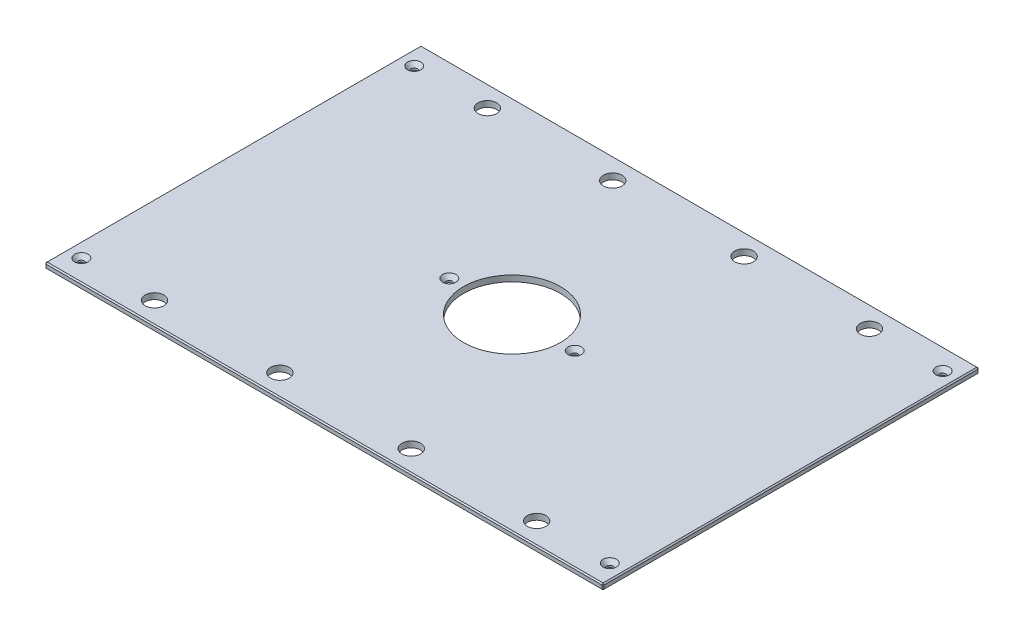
from build123d import *

# Parameters (mm, degrees)
SKETCH1_W                                     = 593.725
SKETCH1_H                                     = 400.05
BOSS_EXTRUDE1_DEPTH                           = 6.35
SKETCH13_R                                    = 51.562
CUT_EXTRUDE6_DEPTH                            = 359.019087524
F_25_32_0_78125_DIAMETER_HOLE1_D              = 19.84375
CHAMFER2_SIZE                                 = 1.27
CSK_FOR_1_4_FLAT_HEAD_MACHINE_SCREW1_AT_COUNT = 2
CSK_FOR_1_4_FLAT_HEAD_MACHINE_SCREW1_AT_PITCH = 354.00996
CSK_FOR_1_4_FLAT_HEAD_MACHINE_SCREW1_2_COUNT  = 2
CSK_FOR_1_4_FLAT_HEAD_MACHINE_SCREW1_2_PITCH  = 664.182920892
CSK_FOR_1_4_FLAT_HEAD_MACHINE_SCREW1_3_COUNT  = 2
CSK_FOR_1_4_FLAT_HEAD_MACHINE_SCREW1_3_PITCH  = 390.128154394
CSK_FOR_1_4_FLAT_HEAD_MACHINE_SCREW1_4_COUNT  = 2
CSK_FOR_1_4_FLAT_HEAD_MACHINE_SCREW1_4_PITCH  = 277.957929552
CSK_FOR_1_4_FLAT_HEAD_MACHINE_SCREW1_5_COUNT  = 2
CSK_FOR_1_4_FLAT_HEAD_MACHINE_SCREW1_5_PITCH  = 561.975
CSK_FOR_1_4_FLAT_HEAD_MACHINE_SCREW1_6_COUNT  = 2
CSK_FOR_1_4_FLAT_HEAD_MACHINE_SCREW1_6_PITCH  = 484.1875
CSK_FOR_1_4_FLAT_HEAD_MACHINE_SCREW1_7_COUNT  = 2
CSK_FOR_1_4_FLAT_HEAD_MACHINE_SCREW1_7_PITCH  = 599.800455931


with BuildPart() as part:
    # Sketch1 → Boss-Extrude1 (new body)
    with BuildSketch(Plane(origin=(0, 0, 0), x_dir=(1, 0, 0), z_dir=(0, 1, 0))):
        Rectangle(SKETCH1_W, SKETCH1_H)
    extrude(amount=BOSS_EXTRUDE1_DEPTH)

    # Sketch13 → Cut-Extrude6 (cut, through all)
    with BuildSketch(Plane(origin=(0, 6.35, 0), x_dir=(1, 0, 0), z_dir=(0, 1, 0))):
        with Locations(Location((0, 0, 0), (0, 0, 270))):
            Circle(SKETCH13_R)
    extrude(amount=-CUT_EXTRUDE6_DEPTH, mode=Mode.SUBTRACT)

    # 25_32 _0.78125_ Diameter Hole1 (through all)
    with Locations(Plane(origin=(0, 6.35, 0), x_dir=(1, 0, 0), z_dir=(0, 1, 0))):
        with Locations((203.2, 177.00498), (-203.2, 177.00498), (203.2, -177.00498), (-203.2, -177.00498), (-69.85, 177.00498), (69.85, 177.00498), (69.85, -177.00498), (-69.85, -177.00498)):
            Hole(F_25_32_0_78125_DIAMETER_HOLE1_D / 2)

    # Chamfer2
    chamfer2_edges = [part.edges().sort_by_distance(p)[0] for p in [
        (296.8625, 6.35, 0),
        (0, 6.35, -200.025),
        (-296.8625, 6.35, 0),
        (0, 0, -200.025),
        (296.8625, 0, 0),
        (0, 0, 200.025),
        (-296.8625, 0, 0),
        (0, 6.35, 200.025),
        (-296.8625, 3.175, -200.025),
        (296.8625, 3.175, -200.025),
        (296.8625, 3.175, 200.025),
        (-296.8625, 3.175, 200.025),
    ]]
    chamfer(chamfer2_edges, length=CHAMFER2_SIZE)

    # Sketch24 → CSK for 1_4 Flat Head Machine Screw1 (revolve, cut)
    with BuildSketch(Plane(origin=(280.9875, 6.35, -177.00498), x_dir=(0, 0, 1), z_dir=(1, 0, 0))):
        Polygon((0, 0), (0, 6.35), (3.3782, 6.35), (3.3782, 4.324464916), (7.1374, 0), align=None)
    csk_for_1_4_flat_head_machine_screw1 = revolve(axis=Axis((280.9875, 12.7, -177.00498), (0, -1, 0)), mode=Mode.SUBTRACT)

    # CSK for 1_4 Flat Head Machine Screw1 at: CSK for 1_4 Flat Head Machine Screw1 ×2
    with Locations(*[(0, 0, i * CSK_FOR_1_4_FLAT_HEAD_MACHINE_SCREW1_AT_PITCH) for i in range(1, CSK_FOR_1_4_FLAT_HEAD_MACHINE_SCREW1_AT_COUNT)]):
        add(csk_for_1_4_flat_head_machine_screw1, mode=Mode.SUBTRACT)

    # CSK for 1_4 Flat Head Machine Screw1 2: CSK for 1_4 Flat Head Machine Screw1 ×2
    with Locations(*[Vector(-0.8461148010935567, 0, 0.5330006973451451) * (i * CSK_FOR_1_4_FLAT_HEAD_MACHINE_SCREW1_2_PITCH) for i in range(1, CSK_FOR_1_4_FLAT_HEAD_MACHINE_SCREW1_2_COUNT)]):
        add(csk_for_1_4_flat_head_machine_screw1, mode=Mode.SUBTRACT)

    # CSK for 1_4 Flat Head Machine Screw1 3: CSK for 1_4 Flat Head Machine Screw1 ×2
    with Locations(*[Vector(-0.8911494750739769, 0, 0.45370983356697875) * (i * CSK_FOR_1_4_FLAT_HEAD_MACHINE_SCREW1_3_PITCH) for i in range(1, CSK_FOR_1_4_FLAT_HEAD_MACHINE_SCREW1_3_COUNT)]):
        add(csk_for_1_4_flat_head_machine_screw1, mode=Mode.SUBTRACT)

    # CSK for 1_4 Flat Head Machine Screw1 4: CSK for 1_4 Flat Head Machine Screw1 ×2
    with Locations(*[Vector(-0.771024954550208, 0, 0.6368049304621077) * (i * CSK_FOR_1_4_FLAT_HEAD_MACHINE_SCREW1_4_PITCH) for i in range(1, CSK_FOR_1_4_FLAT_HEAD_MACHINE_SCREW1_4_COUNT)]):
        add(csk_for_1_4_flat_head_machine_screw1, mode=Mode.SUBTRACT)

    # CSK for 1_4 Flat Head Machine Screw1 5: CSK for 1_4 Flat Head Machine Screw1 ×2
    with Locations(*[(-i * CSK_FOR_1_4_FLAT_HEAD_MACHINE_SCREW1_5_PITCH, 0, 0) for i in range(1, CSK_FOR_1_4_FLAT_HEAD_MACHINE_SCREW1_5_COUNT)]):
        add(csk_for_1_4_flat_head_machine_screw1, mode=Mode.SUBTRACT)

    # CSK for 1_4 Flat Head Machine Screw1 6: CSK for 1_4 Flat Head Machine Screw1 ×2
    with Locations(*[(-i * CSK_FOR_1_4_FLAT_HEAD_MACHINE_SCREW1_6_PITCH, 0, 0) for i in range(1, CSK_FOR_1_4_FLAT_HEAD_MACHINE_SCREW1_6_COUNT)]):
        add(csk_for_1_4_flat_head_machine_screw1, mode=Mode.SUBTRACT)

    # CSK for 1_4 Flat Head Machine Screw1 7: CSK for 1_4 Flat Head Machine Screw1 ×2
    with Locations(*[Vector(-0.8072476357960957, 0, 0.5902128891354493) * (i * CSK_FOR_1_4_FLAT_HEAD_MACHINE_SCREW1_7_PITCH) for i in range(1, CSK_FOR_1_4_FLAT_HEAD_MACHINE_SCREW1_7_COUNT)]):
        add(csk_for_1_4_flat_head_machine_screw1, mode=Mode.SUBTRACT)


solid = part.part
